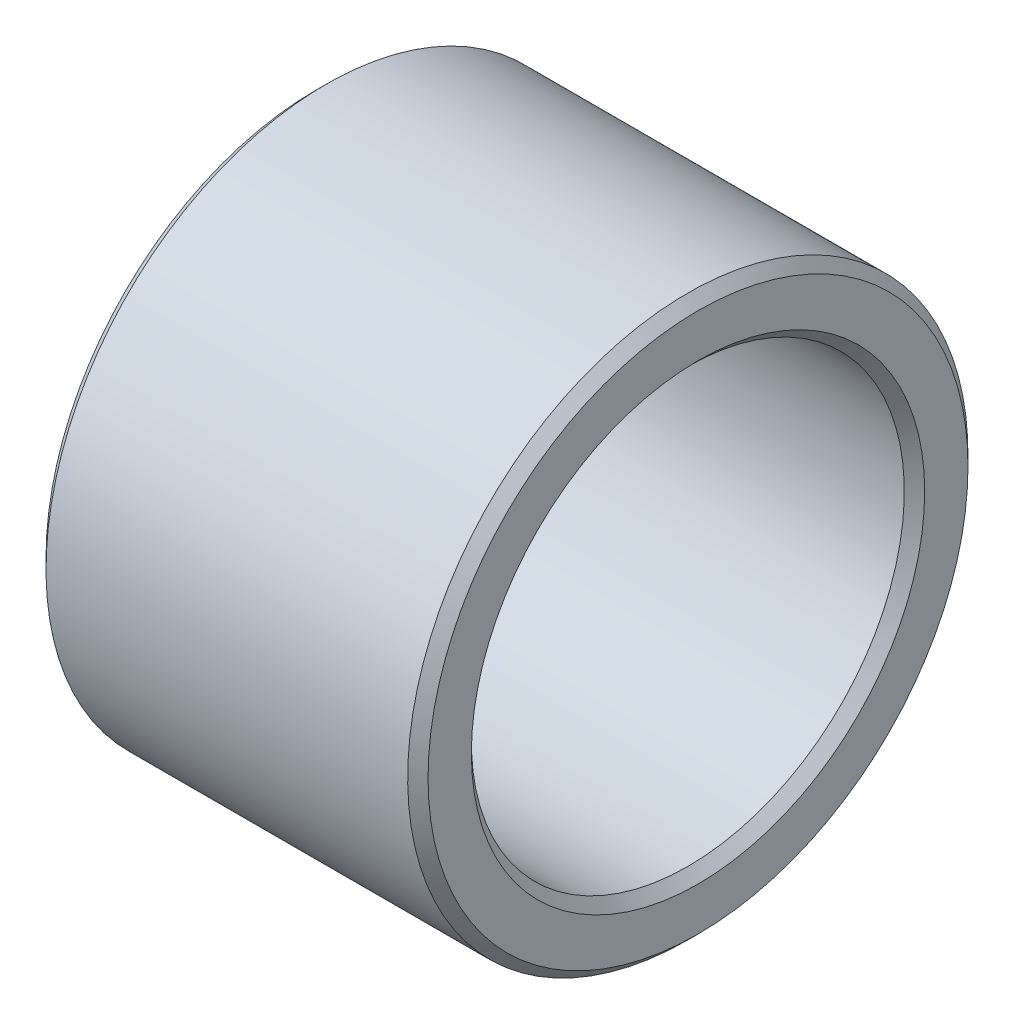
ISO-10303-21;
HEADER;
FILE_DESCRIPTION(('STEP AP214'),'2;1');
FILE_NAME('part.step','',(''),(''),'','','');
FILE_SCHEMA(('AUTOMOTIVE_DESIGN { 1 0 10303 214 1 1 1 1 }'));
ENDSEC;
DATA;
#1=APPLICATION_CONTEXT('core data for automotive mechanical design processes');
#2=APPLICATION_PROTOCOL_DEFINITION('international standard','automotive_design',2000,#1);
#3=PRODUCT_CONTEXT('',#1,'mechanical');
#4=PRODUCT('Part','Part','',(#3));
#5=PRODUCT_RELATED_PRODUCT_CATEGORY('part','',(#4));
#6=PRODUCT_DEFINITION_FORMATION('','',#4);
#7=PRODUCT_DEFINITION_CONTEXT('part definition',#1,'design');
#8=PRODUCT_DEFINITION('design','',#6,#7);
#9=PRODUCT_DEFINITION_SHAPE('','',#8);
#10=(LENGTH_UNIT() NAMED_UNIT(*) SI_UNIT(.MILLI.,.METRE.));
#11=(NAMED_UNIT(*) PLANE_ANGLE_UNIT() SI_UNIT($,.RADIAN.));
#12=(NAMED_UNIT(*) SI_UNIT($,.STERADIAN.) SOLID_ANGLE_UNIT());
#13=UNCERTAINTY_MEASURE_WITH_UNIT(LENGTH_MEASURE(1.E-05),#10,'distance_accuracy_value','');
#14=(GEOMETRIC_REPRESENTATION_CONTEXT(3) GLOBAL_UNCERTAINTY_ASSIGNED_CONTEXT((#13)) GLOBAL_UNIT_ASSIGNED_CONTEXT((#10,
#11,#12)) REPRESENTATION_CONTEXT('',''));
#15=CARTESIAN_POINT('',(0.,0.,0.));
#16=DIRECTION('',(0.,0.,1.));
#17=DIRECTION('',(1.,0.,0.));
#18=AXIS2_PLACEMENT_3D('',#15,#16,#17);
#19=CARTESIAN_POINT('',(0.,-9.75,0.));
#20=DIRECTION('',(-1.,0.,0.));
#21=DIRECTION('',(0.,1.,0.));
#22=AXIS2_PLACEMENT_3D('',#19,#20,#21);
#23=PLANE('',#22);
#24=CARTESIAN_POINT('',(0.,0.,0.));
#25=DIRECTION('',(1.,0.,0.));
#26=DIRECTION('',(0.,-1.,0.));
#27=AXIS2_PLACEMENT_3D('',#24,#25,#26);
#28=CIRCLE('',#27,8.9);
#29=CARTESIAN_POINT('',(0.,-8.9,0.));
#30=VERTEX_POINT('',#29);
#31=EDGE_CURVE('E9',#30,#30,#28,.T.);
#32=ORIENTED_EDGE('',*,*,#31,.T.);
#33=EDGE_LOOP('',(#32));
#34=FACE_BOUND('',#33,.T.);
#35=CARTESIAN_POINT('',(0.,0.,0.));
#36=DIRECTION('',(1.,0.,0.));
#37=DIRECTION('',(0.,-1.,0.));
#38=AXIS2_PLACEMENT_3D('',#35,#36,#37);
#39=CIRCLE('',#38,10.6);
#40=CARTESIAN_POINT('',(0.,-10.6,0.));
#41=VERTEX_POINT('',#40);
#42=EDGE_CURVE('E53',#41,#41,#39,.T.);
#43=ORIENTED_EDGE('',*,*,#42,.F.);
#44=EDGE_LOOP('',(#43));
#45=FACE_BOUND('',#44,.T.);
#46=ADVANCED_FACE('F15',(#34,#45),#23,.T.);
#47=CARTESIAN_POINT('',(0.2,0.,0.));
#48=DIRECTION('',(-1.,0.,0.));
#49=DIRECTION('',(0.,-1.,0.));
#50=AXIS2_PLACEMENT_3D('',#47,#48,#49);
#51=CONICAL_SURFACE('',#50,8.7,0.785398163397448);
#52=CARTESIAN_POINT('',(0.4,0.,0.));
#53=DIRECTION('',(1.,0.,0.));
#54=DIRECTION('',(0.,-1.,0.));
#55=AXIS2_PLACEMENT_3D('',#52,#53,#54);
#56=CIRCLE('',#55,8.5);
#57=CARTESIAN_POINT('',(0.4,-8.5,0.));
#58=VERTEX_POINT('',#57);
#59=EDGE_CURVE('E22',#58,#58,#56,.T.);
#60=ORIENTED_EDGE('',*,*,#59,.T.);
#61=EDGE_LOOP('',(#60));
#62=FACE_BOUND('',#61,.T.);
#63=ORIENTED_EDGE('',*,*,#31,.F.);
#64=EDGE_LOOP('',(#63));
#65=FACE_BOUND('',#64,.T.);
#66=ADVANCED_FACE('F82',(#62,#65),#51,.F.);
#67=CARTESIAN_POINT('',(7.5,0.,0.));
#68=DIRECTION('',(-1.,0.,0.));
#69=DIRECTION('',(0.,-1.,0.));
#70=AXIS2_PLACEMENT_3D('',#67,#68,#69);
#71=CYLINDRICAL_SURFACE('',#70,8.5);
#72=CARTESIAN_POINT('',(14.6,0.,0.));
#73=DIRECTION('',(1.,0.,0.));
#74=DIRECTION('',(0.,-1.,0.));
#75=AXIS2_PLACEMENT_3D('',#72,#73,#74);
#76=CIRCLE('',#75,8.5);
#77=CARTESIAN_POINT('',(14.6,-8.5,0.));
#78=VERTEX_POINT('',#77);
#79=EDGE_CURVE('E58',#78,#78,#76,.T.);
#80=ORIENTED_EDGE('',*,*,#79,.T.);
#81=EDGE_LOOP('',(#80));
#82=FACE_BOUND('',#81,.T.);
#83=ORIENTED_EDGE('',*,*,#59,.F.);
#84=EDGE_LOOP('',(#83));
#85=FACE_BOUND('',#84,.T.);
#86=ADVANCED_FACE('F66',(#82,#85),#71,.F.);
#87=CARTESIAN_POINT('',(14.8,0.,0.));
#88=DIRECTION('',(1.,0.,0.));
#89=DIRECTION('',(0.,-1.,0.));
#90=AXIS2_PLACEMENT_3D('',#87,#88,#89);
#91=CONICAL_SURFACE('',#90,8.7,0.785398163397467);
#92=CARTESIAN_POINT('',(15.,0.,0.));
#93=DIRECTION('',(1.,0.,0.));
#94=DIRECTION('',(0.,-1.,0.));
#95=AXIS2_PLACEMENT_3D('',#92,#93,#94);
#96=CIRCLE('',#95,8.9);
#97=CARTESIAN_POINT('',(15.,-8.9,0.));
#98=VERTEX_POINT('',#97);
#99=EDGE_CURVE('E63',#98,#98,#96,.T.);
#100=ORIENTED_EDGE('',*,*,#99,.T.);
#101=EDGE_LOOP('',(#100));
#102=FACE_BOUND('',#101,.T.);
#103=ORIENTED_EDGE('',*,*,#79,.F.);
#104=EDGE_LOOP('',(#103));
#105=FACE_BOUND('',#104,.T.);
#106=ADVANCED_FACE('F69',(#102,#105),#91,.F.);
#107=CARTESIAN_POINT('',(15.,-9.75,0.));
#108=DIRECTION('',(1.,0.,0.));
#109=DIRECTION('',(0.,-1.,0.));
#110=AXIS2_PLACEMENT_3D('',#107,#108,#109);
#111=PLANE('',#110);
#112=CARTESIAN_POINT('',(15.,0.,0.));
#113=DIRECTION('',(1.,0.,0.));
#114=DIRECTION('',(0.,-1.,0.));
#115=AXIS2_PLACEMENT_3D('',#112,#113,#114);
#116=CIRCLE('',#115,10.6);
#117=CARTESIAN_POINT('',(15.,-10.6,0.));
#118=VERTEX_POINT('',#117);
#119=EDGE_CURVE('E61',#118,#118,#116,.T.);
#120=ORIENTED_EDGE('',*,*,#119,.T.);
#121=EDGE_LOOP('',(#120));
#122=FACE_BOUND('',#121,.T.);
#123=ORIENTED_EDGE('',*,*,#99,.F.);
#124=EDGE_LOOP('',(#123));
#125=FACE_BOUND('',#124,.T.);
#126=ADVANCED_FACE('F71',(#122,#125),#111,.T.);
#127=CARTESIAN_POINT('',(14.8,0.,0.));
#128=DIRECTION('',(-1.,0.,0.));
#129=DIRECTION('',(0.,-1.,0.));
#130=AXIS2_PLACEMENT_3D('',#127,#128,#129);
#131=CONICAL_SURFACE('',#130,10.8,0.785398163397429);
#132=CARTESIAN_POINT('',(14.6,0.,0.));
#133=DIRECTION('',(1.,0.,0.));
#134=DIRECTION('',(0.,-1.,0.));
#135=AXIS2_PLACEMENT_3D('',#132,#133,#134);
#136=CIRCLE('',#135,11.);
#137=CARTESIAN_POINT('',(14.6,-11.,0.));
#138=VERTEX_POINT('',#137);
#139=EDGE_CURVE('E55',#138,#138,#136,.T.);
#140=ORIENTED_EDGE('',*,*,#139,.T.);
#141=EDGE_LOOP('',(#140));
#142=FACE_BOUND('',#141,.T.);
#143=ORIENTED_EDGE('',*,*,#119,.F.);
#144=EDGE_LOOP('',(#143));
#145=FACE_BOUND('',#144,.T.);
#146=ADVANCED_FACE('F79',(#142,#145),#131,.T.);
#147=CARTESIAN_POINT('',(7.5,0.,0.));
#148=DIRECTION('',(-1.,0.,0.));
#149=DIRECTION('',(0.,-1.,0.));
#150=AXIS2_PLACEMENT_3D('',#147,#148,#149);
#151=CYLINDRICAL_SURFACE('',#150,11.);
#152=CARTESIAN_POINT('',(0.4,0.,0.));
#153=DIRECTION('',(1.,0.,0.));
#154=DIRECTION('',(0.,-1.,0.));
#155=AXIS2_PLACEMENT_3D('',#152,#153,#154);
#156=CIRCLE('',#155,11.);
#157=CARTESIAN_POINT('',(0.4,-11.,0.));
#158=VERTEX_POINT('',#157);
#159=EDGE_CURVE('E49',#158,#158,#156,.T.);
#160=ORIENTED_EDGE('',*,*,#159,.T.);
#161=EDGE_LOOP('',(#160));
#162=FACE_BOUND('',#161,.T.);
#163=ORIENTED_EDGE('',*,*,#139,.F.);
#164=EDGE_LOOP('',(#163));
#165=FACE_BOUND('',#164,.T.);
#166=ADVANCED_FACE('F50',(#162,#165),#151,.T.);
#167=CARTESIAN_POINT('',(0.2,0.,0.));
#168=DIRECTION('',(1.,0.,0.));
#169=DIRECTION('',(0.,-1.,0.));
#170=AXIS2_PLACEMENT_3D('',#167,#168,#169);
#171=CONICAL_SURFACE('',#170,10.8,0.785398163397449);
#172=ORIENTED_EDGE('',*,*,#42,.T.);
#173=EDGE_LOOP('',(#172));
#174=FACE_BOUND('',#173,.T.);
#175=ORIENTED_EDGE('',*,*,#159,.F.);
#176=EDGE_LOOP('',(#175));
#177=FACE_BOUND('',#176,.T.);
#178=ADVANCED_FACE('F92',(#174,#177),#171,.T.);
#179=CLOSED_SHELL('',(#46,#66,#86,#106,#126,#146,#166,#178));
#180=MANIFOLD_SOLID_BREP('B1',#179);
#181=ADVANCED_BREP_SHAPE_REPRESENTATION('',(#18,#180),#14);
#182=SHAPE_DEFINITION_REPRESENTATION(#9,#181);
ENDSEC;
END-ISO-10303-21;
